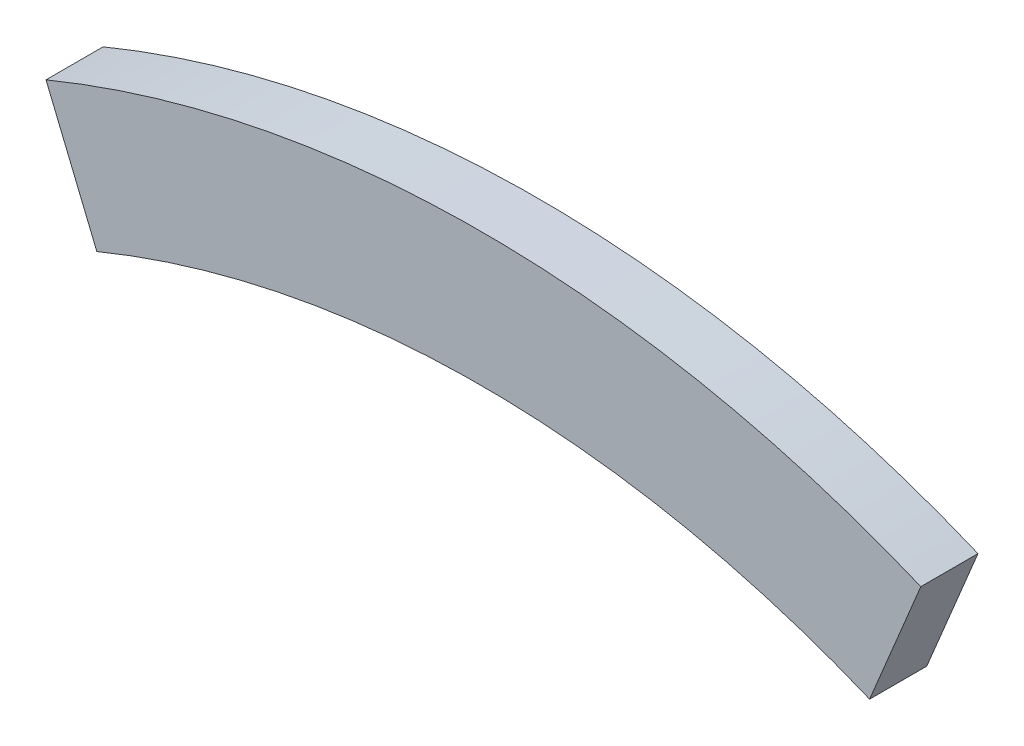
ISO-10303-21;
HEADER;
FILE_DESCRIPTION(('STEP AP214'),'2;1');
FILE_NAME('part.step','',(''),(''),'','','');
FILE_SCHEMA(('AUTOMOTIVE_DESIGN { 1 0 10303 214 1 1 1 1 }'));
ENDSEC;
DATA;
#1=APPLICATION_CONTEXT('core data for automotive mechanical design processes');
#2=APPLICATION_PROTOCOL_DEFINITION('international standard','automotive_design',2000,#1);
#3=PRODUCT_CONTEXT('',#1,'mechanical');
#4=PRODUCT('Part','Part','',(#3));
#5=PRODUCT_RELATED_PRODUCT_CATEGORY('part','',(#4));
#6=PRODUCT_DEFINITION_FORMATION('','',#4);
#7=PRODUCT_DEFINITION_CONTEXT('part definition',#1,'design');
#8=PRODUCT_DEFINITION('design','',#6,#7);
#9=PRODUCT_DEFINITION_SHAPE('','',#8);
#10=(LENGTH_UNIT() NAMED_UNIT(*) SI_UNIT(.MILLI.,.METRE.));
#11=(NAMED_UNIT(*) PLANE_ANGLE_UNIT() SI_UNIT($,.RADIAN.));
#12=(NAMED_UNIT(*) SI_UNIT($,.STERADIAN.) SOLID_ANGLE_UNIT());
#13=UNCERTAINTY_MEASURE_WITH_UNIT(LENGTH_MEASURE(1.E-05),#10,'distance_accuracy_value','');
#14=(GEOMETRIC_REPRESENTATION_CONTEXT(3) GLOBAL_UNCERTAINTY_ASSIGNED_CONTEXT((#13)) GLOBAL_UNIT_ASSIGNED_CONTEXT((#10,
#11,#12)) REPRESENTATION_CONTEXT('',''));
#15=CARTESIAN_POINT('',(0.,0.,0.));
#16=DIRECTION('',(0.,0.,1.));
#17=DIRECTION('',(1.,0.,0.));
#18=AXIS2_PLACEMENT_3D('',#15,#16,#17);
#19=CARTESIAN_POINT('',(256.527425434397,-622.3,38.1));
#20=DIRECTION('',(0.,0.,-1.));
#21=DIRECTION('',(-1.,0.,0.));
#22=AXIS2_PLACEMENT_3D('',#19,#20,#21);
#23=CYLINDRICAL_SURFACE('',#22,762.);
#24=CARTESIAN_POINT('',(256.527425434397,-622.3,0.));
#25=DIRECTION('',(0.,0.,1.));
#26=DIRECTION('',(1.,0.,0.));
#27=AXIS2_PLACEMENT_3D('',#24,#25,#26);
#28=CIRCLE('',#27,762.);
#29=CARTESIAN_POINT('',(-33.8809807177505,82.1905660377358,0.));
#30=VERTEX_POINT('',#29);
#31=CARTESIAN_POINT('',(549.32772865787,81.1998098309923,0.));
#32=VERTEX_POINT('',#31);
#33=EDGE_CURVE('E99',#30,#32,#28,.F.);
#34=ORIENTED_EDGE('',*,*,#33,.F.);
#35=DIRECTION('',(0.,0.,-1.));
#36=VECTOR('',#35,1.);
#37=CARTESIAN_POINT('',(-33.8809807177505,82.1905660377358,38.1));
#38=LINE('',#37,#36);
#39=CARTESIAN_POINT('',(-33.8809807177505,82.1905660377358,38.1));
#40=VERTEX_POINT('',#39);
#41=EDGE_CURVE('E11',#40,#30,#38,.T.);
#42=ORIENTED_EDGE('',*,*,#41,.F.);
#43=CARTESIAN_POINT('',(256.527425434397,-622.3,38.1));
#44=DIRECTION('',(0.,0.,1.));
#45=DIRECTION('',(1.,0.,0.));
#46=AXIS2_PLACEMENT_3D('',#43,#44,#45);
#47=CIRCLE('',#46,762.);
#48=CARTESIAN_POINT('',(549.32772865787,81.1998098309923,38.1));
#49=VERTEX_POINT('',#48);
#50=EDGE_CURVE('E93',#40,#49,#47,.F.);
#51=ORIENTED_EDGE('',*,*,#50,.T.);
#52=DIRECTION('',(0.,0.,-1.));
#53=VECTOR('',#52,1.);
#54=CARTESIAN_POINT('',(549.32772865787,81.1998098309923,38.1));
#55=LINE('',#54,#53);
#56=EDGE_CURVE('E74',#49,#32,#55,.T.);
#57=ORIENTED_EDGE('',*,*,#56,.T.);
#58=EDGE_LOOP('',(#34,#42,#51,#57));
#59=FACE_BOUND('',#58,.T.);
#60=ADVANCED_FACE('F36',(#59),#23,.T.);
#61=CARTESIAN_POINT('',(0.,0.,38.1));
#62=DIRECTION('',(-0.924528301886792,-0.381113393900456,0.));
#63=DIRECTION('',(0.381113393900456,-0.924528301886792,0.));
#64=AXIS2_PLACEMENT_3D('',#61,#62,#63);
#65=PLANE('',#64);
#66=DIRECTION('',(-0.381113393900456,0.924528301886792,0.));
#67=VECTOR('',#66,1.);
#68=CARTESIAN_POINT('',(0.,0.,0.));
#69=LINE('',#68,#67);
#70=CARTESIAN_POINT('',(0.,0.,0.));
#71=VERTEX_POINT('',#70);
#72=EDGE_CURVE('E87',#71,#30,#69,.T.);
#73=ORIENTED_EDGE('',*,*,#72,.F.);
#74=DIRECTION('',(0.,0.,-1.));
#75=VECTOR('',#74,1.);
#76=CARTESIAN_POINT('',(0.,0.,38.1));
#77=LINE('',#76,#75);
#78=CARTESIAN_POINT('',(0.,0.,38.1));
#79=VERTEX_POINT('',#78);
#80=EDGE_CURVE('E44',#79,#71,#77,.T.);
#81=ORIENTED_EDGE('',*,*,#80,.F.);
#82=DIRECTION('',(-0.381113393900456,0.924528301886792,0.));
#83=VECTOR('',#82,1.);
#84=CARTESIAN_POINT('',(0.,0.,38.1));
#85=LINE('',#84,#83);
#86=EDGE_CURVE('E85',#79,#40,#85,.T.);
#87=ORIENTED_EDGE('',*,*,#86,.T.);
#88=ORIENTED_EDGE('',*,*,#41,.T.);
#89=EDGE_LOOP('',(#73,#81,#87,#88));
#90=FACE_BOUND('',#89,.T.);
#91=ADVANCED_FACE('F83',(#90),#65,.T.);
#92=CARTESIAN_POINT('',(256.527425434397,-622.3,38.1));
#93=DIRECTION('',(0.,0.,-1.));
#94=DIRECTION('',(-1.,0.,0.));
#95=AXIS2_PLACEMENT_3D('',#92,#93,#94);
#96=CYLINDRICAL_SURFACE('',#95,673.1);
#97=CARTESIAN_POINT('',(256.527425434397,-622.3,0.));
#98=DIRECTION('',(0.,0.,1.));
#99=DIRECTION('',(1.,0.,0.));
#100=AXIS2_PLACEMENT_3D('',#97,#98,#99);
#101=CIRCLE('',#100,673.1);
#102=CARTESIAN_POINT('',(515.167693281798,-0.875167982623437,0.));
#103=VERTEX_POINT('',#102);
#104=EDGE_CURVE('E67',#71,#103,#101,.F.);
#105=ORIENTED_EDGE('',*,*,#104,.T.);
#106=DIRECTION('',(0.,0.,-1.));
#107=VECTOR('',#106,1.);
#108=CARTESIAN_POINT('',(515.167693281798,-0.875167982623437,38.1));
#109=LINE('',#108,#107);
#110=CARTESIAN_POINT('',(515.167693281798,-0.875167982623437,38.1));
#111=VERTEX_POINT('',#110);
#112=EDGE_CURVE('E88',#111,#103,#109,.T.);
#113=ORIENTED_EDGE('',*,*,#112,.F.);
#114=CARTESIAN_POINT('',(256.527425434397,-622.3,38.1));
#115=DIRECTION('',(0.,0.,1.));
#116=DIRECTION('',(1.,0.,0.));
#117=AXIS2_PLACEMENT_3D('',#114,#115,#116);
#118=CIRCLE('',#117,673.1);
#119=EDGE_CURVE('E89',#79,#111,#118,.F.);
#120=ORIENTED_EDGE('',*,*,#119,.F.);
#121=ORIENTED_EDGE('',*,*,#80,.T.);
#122=EDGE_LOOP('',(#105,#113,#120,#121));
#123=FACE_BOUND('',#122,.T.);
#124=ADVANCED_FACE('F90',(#123),#96,.F.);
#125=CARTESIAN_POINT('',(439.413712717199,-182.886287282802,38.1));
#126=DIRECTION('',(-0.923228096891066,0.384252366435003,0.));
#127=DIRECTION('',(-0.384252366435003,-0.923228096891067,0.));
#128=AXIS2_PLACEMENT_3D('',#125,#126,#127);
#129=PLANE('',#128);
#130=DIRECTION('',(0.384252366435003,0.923228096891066,0.));
#131=VECTOR('',#130,1.);
#132=CARTESIAN_POINT('',(439.413712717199,-182.886287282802,0.));
#133=LINE('',#132,#131);
#134=EDGE_CURVE('E95',#103,#32,#133,.T.);
#135=ORIENTED_EDGE('',*,*,#134,.T.);
#136=ORIENTED_EDGE('',*,*,#56,.F.);
#137=DIRECTION('',(0.384252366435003,0.923228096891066,0.));
#138=VECTOR('',#137,1.);
#139=CARTESIAN_POINT('',(439.413712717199,-182.886287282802,38.1));
#140=LINE('',#139,#138);
#141=EDGE_CURVE('E52',#111,#49,#140,.T.);
#142=ORIENTED_EDGE('',*,*,#141,.F.);
#143=ORIENTED_EDGE('',*,*,#112,.T.);
#144=EDGE_LOOP('',(#135,#136,#142,#143));
#145=FACE_BOUND('',#144,.T.);
#146=ADVANCED_FACE('F108',(#145),#129,.F.);
#147=CARTESIAN_POINT('',(0.,0.,38.1));
#148=DIRECTION('',(0.,0.,1.));
#149=DIRECTION('',(1.,0.,0.));
#150=AXIS2_PLACEMENT_3D('',#147,#148,#149);
#151=PLANE('',#150);
#152=ORIENTED_EDGE('',*,*,#50,.F.);
#153=ORIENTED_EDGE('',*,*,#86,.F.);
#154=ORIENTED_EDGE('',*,*,#119,.T.);
#155=ORIENTED_EDGE('',*,*,#141,.T.);
#156=EDGE_LOOP('',(#152,#153,#154,#155));
#157=FACE_BOUND('',#156,.T.);
#158=ADVANCED_FACE('F92',(#157),#151,.T.);
#159=CARTESIAN_POINT('',(0.,0.,0.));
#160=DIRECTION('',(0.,0.,1.));
#161=DIRECTION('',(1.,0.,0.));
#162=AXIS2_PLACEMENT_3D('',#159,#160,#161);
#163=PLANE('',#162);
#164=ORIENTED_EDGE('',*,*,#33,.T.);
#165=ORIENTED_EDGE('',*,*,#134,.F.);
#166=ORIENTED_EDGE('',*,*,#104,.F.);
#167=ORIENTED_EDGE('',*,*,#72,.T.);
#168=EDGE_LOOP('',(#164,#165,#166,#167));
#169=FACE_BOUND('',#168,.T.);
#170=ADVANCED_FACE('F110',(#169),#163,.F.);
#171=CLOSED_SHELL('',(#60,#91,#124,#146,#158,#170));
#172=MANIFOLD_SOLID_BREP('B2',#171);
#173=ADVANCED_BREP_SHAPE_REPRESENTATION('',(#18,#172),#14);
#174=SHAPE_DEFINITION_REPRESENTATION(#9,#173);
ENDSEC;
END-ISO-10303-21;
